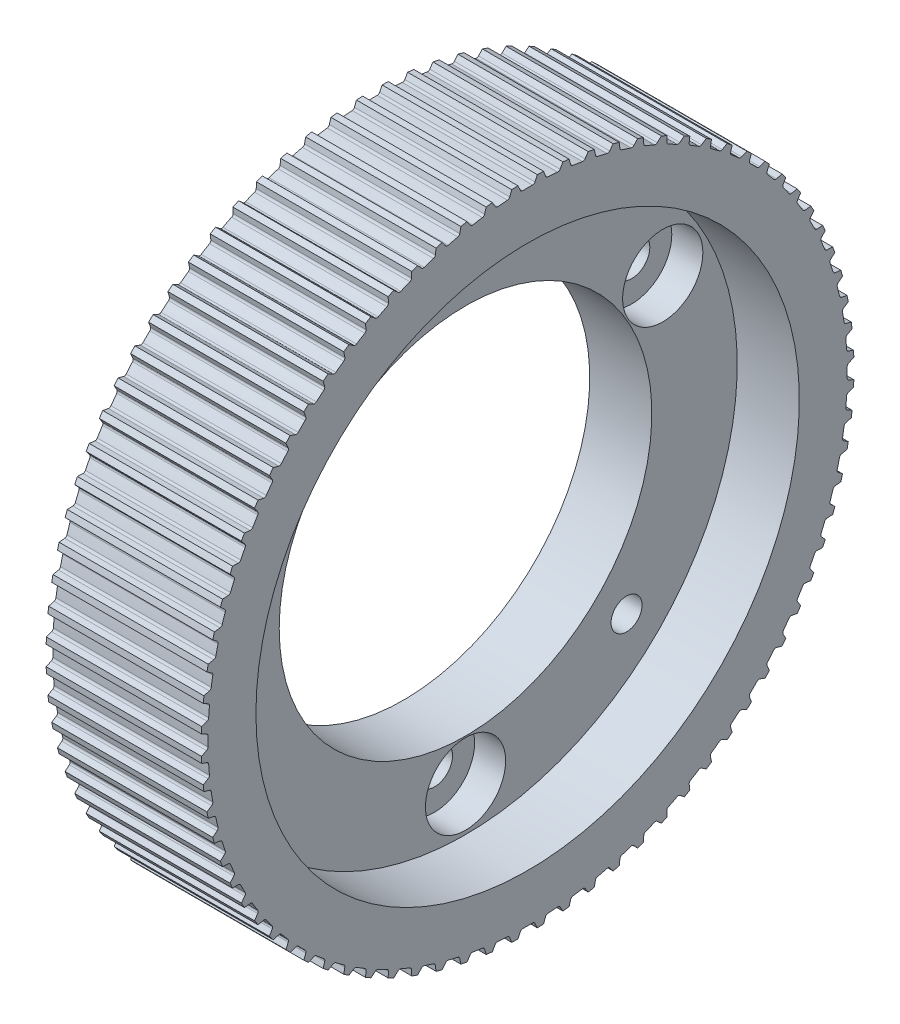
from build123d import *

# Parameters (mm, degrees)
ENL_V_MAT_EXTRU_1_REACH      = 92.965
ESQUISSE2_R                  = 3
ESQUISSE2_R_2                = 3.5
ESQUISSE3_R                  = 7.75
ENL_V_MAT_EXTRU_3_DEPTH      = 6
R_P_TITION_CIRCULAIRE1_COUNT = 3
ENL_V_MAT_EXTRU_4_REACH      = 96.078
R_P_TITION_CIRCULAIRE2_COUNT = 80


with BuildPart() as part:
    # Esquisse1 → R_volution1 (revolve)
    with BuildSketch(Plane.XY, mode=Mode.PRIVATE) as r_volution1_sk:
        Polygon((0, 36), (0, 49), (-6, 49), (-6, 63.05), (24, 63.05), (24, 52.5), (12, 52.5), (12, 36), align=None)
    revolve(r_volution1_sk.sketch.rotate(Axis((-35.322537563, 0, 0), (1, 0, 0)), 90), axis=Axis((-35.322537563, 0, 0), (1, 0, 0)))

    # Esquisse2 → Enl_v. mat.-Extru.1 (cut, up to next)
    with BuildSketch(Plane(origin=(12, 0, 0), x_dir=(0, 0, -1), z_dir=(1, 0, 0)), mode=Mode.PRIVATE) as enl_v_mat_extru_1_sk1:
        with Locations((0, 44)):
            Circle(ESQUISSE2_R)
    enl_v_mat_extru_1_tool1 = extrude(enl_v_mat_extru_1_sk1.sketch, amount=-ENL_V_MAT_EXTRU_1_REACH, mode=Mode.PRIVATE) & part.part
    # Esquisse2 → Enl_v. mat.-Extru.1 (cut, up to next)
    with BuildSketch(Plane(origin=(12, 0, 0), x_dir=(0, 0, -1), z_dir=(1, 0, 0)), mode=Mode.PRIVATE) as enl_v_mat_extru_1_sk2:
        with Locations((31.112698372, -31.112698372)):
            Circle(ESQUISSE2_R)
    enl_v_mat_extru_1_tool2 = extrude(enl_v_mat_extru_1_sk2.sketch, amount=-ENL_V_MAT_EXTRU_1_REACH, mode=Mode.PRIVATE) & part.part
    # Esquisse2 → Enl_v. mat.-Extru.1 (cut, up to next)
    with BuildSketch(Plane(origin=(12, 0, 0), x_dir=(0, 0, -1), z_dir=(1, 0, 0)), mode=Mode.PRIVATE) as enl_v_mat_extru_1_sk3:
        with Locations((0, -44)):
            Circle(ESQUISSE2_R_2)
    enl_v_mat_extru_1_tool3 = extrude(enl_v_mat_extru_1_sk3.sketch, amount=-ENL_V_MAT_EXTRU_1_REACH, mode=Mode.PRIVATE) & part.part
    # Esquisse2 → Enl_v. mat.-Extru.1 (cut, up to next)
    with BuildSketch(Plane(origin=(12, 0, 0), x_dir=(0, 0, -1), z_dir=(1, 0, 0)), mode=Mode.PRIVATE) as enl_v_mat_extru_1_sk4:
        with Locations((-38.105117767, 22)):
            Circle(ESQUISSE2_R_2)
    enl_v_mat_extru_1_tool4 = extrude(enl_v_mat_extru_1_sk4.sketch, amount=-ENL_V_MAT_EXTRU_1_REACH, mode=Mode.PRIVATE) & part.part
    # Esquisse2 → Enl_v. mat.-Extru.1 (cut, up to next)
    with BuildSketch(Plane(origin=(12, 0, 0), x_dir=(0, 0, -1), z_dir=(1, 0, 0)), mode=Mode.PRIVATE) as enl_v_mat_extru_1_sk5:
        with Locations((38.105117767, 22)):
            Circle(ESQUISSE2_R_2)
    enl_v_mat_extru_1_tool5 = extrude(enl_v_mat_extru_1_sk5.sketch, amount=-ENL_V_MAT_EXTRU_1_REACH, mode=Mode.PRIVATE) & part.part
    add(enl_v_mat_extru_1_tool1.solids().sort_by_distance((12, 44, 0))[0], mode=Mode.SUBTRACT)
    add(enl_v_mat_extru_1_tool2.solids().sort_by_distance((12, -31.112698, -31.112698))[0], mode=Mode.SUBTRACT)
    add(enl_v_mat_extru_1_tool3.solids().sort_by_distance((12, -44, 0))[0], mode=Mode.SUBTRACT)
    add(enl_v_mat_extru_1_tool4.solids().sort_by_distance((12, 22, 38.105118))[0], mode=Mode.SUBTRACT)
    add(enl_v_mat_extru_1_tool5.solids().sort_by_distance((12, 22, -38.105118))[0], mode=Mode.SUBTRACT)

    # Esquisse3 → Enl_v. mat.-Extru.3 (cut)
    with BuildSketch(Plane(origin=(12, 0, 0), x_dir=(0, 0, -1), z_dir=(1, 0, 0))):
        with Locations((0, -44)):
            Circle(ESQUISSE3_R)
    enl_v_mat_extru_3 = extrude(amount=-ENL_V_MAT_EXTRU_3_DEPTH, mode=Mode.SUBTRACT)

    # R_p_tition circulaire1: Enl_v. mat.-Extru.3 ×3 about axis
    r_p_tition_circulaire1_axis = Axis((0, 0, 0), (1, 0, 0))
    for i in range(1, R_P_TITION_CIRCULAIRE1_COUNT):
        add(enl_v_mat_extru_3.rotate(r_p_tition_circulaire1_axis, i * 360 / R_P_TITION_CIRCULAIRE1_COUNT), mode=Mode.SUBTRACT)

    # Esquisse4 → Enl_v. mat.-Extru.4 (cut, up to next)
    with BuildSketch(Plane(origin=(24, 0, 0), x_dir=(0, 0, -1), z_dir=(1, 0, 0)), mode=Mode.PRIVATE) as enl_v_mat_extru_4_sk1:
        with BuildLine():
            Line((-2.155, 63.633520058), (-1.40790458, 62.031368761))
            ThreePointArc((-1.40790458, 62.031368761), (-1.220158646, 61.818934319), (-0.947082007, 61.742736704))
            ThreePointArc((-0.947082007, 61.742736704), (0, 61.75), (0.947082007, 61.742736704))
            ThreePointArc((0.947082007, 61.742736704), (1.220158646, 61.818934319), (1.40790458, 62.031368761))
            Line((1.40790458, 62.031368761), (2.155, 63.633520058))
            ThreePointArc((2.155, 63.633520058), (0, 63.67), (-2.155, 63.633520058))
        make_face()
    enl_v_mat_extru_4_tool1 = extrude(enl_v_mat_extru_4_sk1.sketch, amount=-ENL_V_MAT_EXTRU_4_REACH, mode=Mode.PRIVATE) & part.part
    enl_v_mat_extru_4 = enl_v_mat_extru_4_tool1.solids().sort_by_distance((24, 62.789836, 0))[0]
    add(enl_v_mat_extru_4, mode=Mode.SUBTRACT)

    # R_p_tition circulaire2: Enl_v. mat.-Extru.4 ×80 about axis
    r_p_tition_circulaire2_axis = Axis((0, 0, 0), (1, 0, 0))
    for i in range(1, R_P_TITION_CIRCULAIRE2_COUNT):
        add(enl_v_mat_extru_4.rotate(r_p_tition_circulaire2_axis, i * 360 / R_P_TITION_CIRCULAIRE2_COUNT), mode=Mode.SUBTRACT)


solid = part.part
